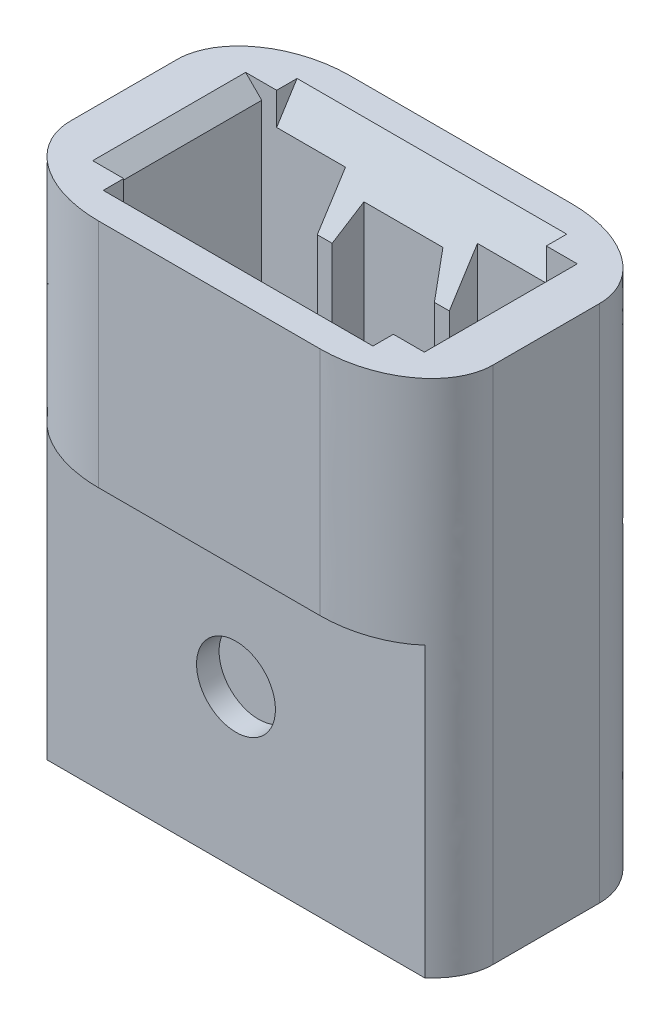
ISO-10303-21;
HEADER;
FILE_DESCRIPTION(('STEP AP214'),'2;1');
FILE_NAME('part.step','',(''),(''),'','','');
FILE_SCHEMA(('AUTOMOTIVE_DESIGN { 1 0 10303 214 1 1 1 1 }'));
ENDSEC;
DATA;
#1=APPLICATION_CONTEXT('core data for automotive mechanical design processes');
#2=APPLICATION_PROTOCOL_DEFINITION('international standard','automotive_design',2000,#1);
#3=PRODUCT_CONTEXT('',#1,'mechanical');
#4=PRODUCT('Part','Part','',(#3));
#5=PRODUCT_RELATED_PRODUCT_CATEGORY('part','',(#4));
#6=PRODUCT_DEFINITION_FORMATION('','',#4);
#7=PRODUCT_DEFINITION_CONTEXT('part definition',#1,'design');
#8=PRODUCT_DEFINITION('design','',#6,#7);
#9=PRODUCT_DEFINITION_SHAPE('','',#8);
#10=(LENGTH_UNIT() NAMED_UNIT(*) SI_UNIT(.MILLI.,.METRE.));
#11=(NAMED_UNIT(*) PLANE_ANGLE_UNIT() SI_UNIT($,.RADIAN.));
#12=(NAMED_UNIT(*) SI_UNIT($,.STERADIAN.) SOLID_ANGLE_UNIT());
#13=UNCERTAINTY_MEASURE_WITH_UNIT(LENGTH_MEASURE(1.E-05),#10,'distance_accuracy_value','');
#14=(GEOMETRIC_REPRESENTATION_CONTEXT(3) GLOBAL_UNCERTAINTY_ASSIGNED_CONTEXT((#13)) GLOBAL_UNIT_ASSIGNED_CONTEXT((#10,
#11,#12)) REPRESENTATION_CONTEXT('',''));
#15=CARTESIAN_POINT('',(0.,0.,0.));
#16=DIRECTION('',(0.,0.,1.));
#17=DIRECTION('',(1.,0.,0.));
#18=AXIS2_PLACEMENT_3D('',#15,#16,#17);
#19=CARTESIAN_POINT('',(-4.7244,-16.383,-2.413));
#20=DIRECTION('',(0.,0.,-1.));
#21=DIRECTION('',(-1.,0.,0.));
#22=AXIS2_PLACEMENT_3D('',#19,#20,#21);
#23=PLANE('',#22);
#24=DIRECTION('',(1.,0.,0.));
#25=VECTOR('',#24,1.);
#26=CARTESIAN_POINT('',(-4.7244,-1.01643211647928,-2.413));
#27=LINE('',#26,#25);
#28=CARTESIAN_POINT('',(-4.2545,-1.01643211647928,-2.413));
#29=VERTEX_POINT('',#28);
#30=CARTESIAN_POINT('',(-2.0828,-1.01643211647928,-2.413));
#31=VERTEX_POINT('',#30);
#32=EDGE_CURVE('E353',#29,#31,#27,.T.);
#33=ORIENTED_EDGE('',*,*,#32,.F.);
#34=DIRECTION('',(0.,-1.,0.));
#35=VECTOR('',#34,1.);
#36=CARTESIAN_POINT('',(-4.2545,-16.383,-2.413));
#37=LINE('',#36,#35);
#38=CARTESIAN_POINT('',(-4.2545,0.,-2.413));
#39=VERTEX_POINT('',#38);
#40=EDGE_CURVE('E366',#39,#29,#37,.T.);
#41=ORIENTED_EDGE('',*,*,#40,.F.);
#42=DIRECTION('',(-1.,0.,0.));
#43=VECTOR('',#42,1.);
#44=CARTESIAN_POINT('',(-4.7244,0.,-2.413));
#45=LINE('',#44,#43);
#46=CARTESIAN_POINT('',(-5.23240000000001,0.,-2.413));
#47=VERTEX_POINT('',#46);
#48=EDGE_CURVE('E451',#39,#47,#45,.T.);
#49=ORIENTED_EDGE('',*,*,#48,.T.);
#50=DIRECTION('',(0.707106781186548,-0.707106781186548,0.));
#51=VECTOR('',#50,1.);
#52=CARTESIAN_POINT('',(3.2131,-8.4455,-2.413));
#53=LINE('',#52,#51);
#54=CARTESIAN_POINT('',(-4.7244,-0.508000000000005,-2.413));
#55=VERTEX_POINT('',#54);
#56=EDGE_CURVE('E683',#47,#55,#53,.T.);
#57=ORIENTED_EDGE('',*,*,#56,.T.);
#58=DIRECTION('',(0.,1.,0.));
#59=VECTOR('',#58,1.);
#60=CARTESIAN_POINT('',(-4.7244,-16.383,-2.413));
#61=LINE('',#60,#59);
#62=CARTESIAN_POINT('',(-4.7244,-16.383,-2.413));
#63=VERTEX_POINT('',#62);
#64=EDGE_CURVE('E480',#63,#55,#61,.T.);
#65=ORIENTED_EDGE('',*,*,#64,.F.);
#66=DIRECTION('',(-1.,0.,0.));
#67=VECTOR('',#66,1.);
#68=CARTESIAN_POINT('',(-4.7244,-16.383,-2.413));
#69=LINE('',#68,#67);
#70=CARTESIAN_POINT('',(-2.0828,-16.383,-2.413));
#71=VERTEX_POINT('',#70);
#72=EDGE_CURVE('E455',#71,#63,#69,.T.);
#73=ORIENTED_EDGE('',*,*,#72,.F.);
#74=DIRECTION('',(0.,1.,0.));
#75=VECTOR('',#74,1.);
#76=CARTESIAN_POINT('',(-2.0828,-16.383,-2.413));
#77=LINE('',#76,#75);
#78=EDGE_CURVE('E434',#71,#31,#77,.T.);
#79=ORIENTED_EDGE('',*,*,#78,.T.);
#80=EDGE_LOOP('',(#33,#41,#49,#57,#65,#73,#79));
#81=FACE_BOUND('',#80,.T.);
#82=ADVANCED_FACE('F34',(#81),#23,.F.);
#83=DIRECTION('',(1.,0.,0.));
#84=VECTOR('',#83,1.);
#85=CARTESIAN_POINT('',(-4.7244,-1.01643211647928,-2.413));
#86=LINE('',#85,#84);
#87=CARTESIAN_POINT('',(2.0828,-1.01643211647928,-2.413));
#88=VERTEX_POINT('',#87);
#89=CARTESIAN_POINT('',(4.2545,-1.01643211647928,-2.413));
#90=VERTEX_POINT('',#89);
#91=EDGE_CURVE('E364',#88,#90,#86,.T.);
#92=ORIENTED_EDGE('',*,*,#91,.F.);
#93=DIRECTION('',(0.,1.,0.));
#94=VECTOR('',#93,1.);
#95=CARTESIAN_POINT('',(2.0828,-16.383,-2.413));
#96=LINE('',#95,#94);
#97=CARTESIAN_POINT('',(2.0828,-16.383,-2.413));
#98=VERTEX_POINT('',#97);
#99=EDGE_CURVE('E438',#98,#88,#96,.T.);
#100=ORIENTED_EDGE('',*,*,#99,.F.);
#101=CARTESIAN_POINT('',(4.7244,-16.383,-2.413));
#102=VERTEX_POINT('',#101);
#103=EDGE_CURVE('E457',#102,#98,#69,.T.);
#104=ORIENTED_EDGE('',*,*,#103,.F.);
#105=DIRECTION('',(0.,1.,0.));
#106=VECTOR('',#105,1.);
#107=CARTESIAN_POINT('',(4.7244,-16.383,-2.413));
#108=LINE('',#107,#106);
#109=CARTESIAN_POINT('',(4.7244,-0.508000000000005,-2.413));
#110=VERTEX_POINT('',#109);
#111=EDGE_CURVE('E467',#102,#110,#108,.T.);
#112=ORIENTED_EDGE('',*,*,#111,.T.);
#113=DIRECTION('',(0.707106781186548,0.707106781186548,0.));
#114=VECTOR('',#113,1.);
#115=CARTESIAN_POINT('',(-7.9375,-13.1699,-2.413));
#116=LINE('',#115,#114);
#117=CARTESIAN_POINT('',(5.23240000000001,0.,-2.413));
#118=VERTEX_POINT('',#117);
#119=EDGE_CURVE('E675',#110,#118,#116,.T.);
#120=ORIENTED_EDGE('',*,*,#119,.T.);
#121=CARTESIAN_POINT('',(4.2545,0.,-2.413));
#122=VERTEX_POINT('',#121);
#123=EDGE_CURVE('E468',#118,#122,#45,.T.);
#124=ORIENTED_EDGE('',*,*,#123,.T.);
#125=DIRECTION('',(0.,-1.,0.));
#126=VECTOR('',#125,1.);
#127=CARTESIAN_POINT('',(4.2545,-16.383,-2.413));
#128=LINE('',#127,#126);
#129=EDGE_CURVE('E687',#122,#90,#128,.T.);
#130=ORIENTED_EDGE('',*,*,#129,.T.);
#131=EDGE_LOOP('',(#92,#100,#104,#112,#120,#124,#130));
#132=FACE_BOUND('',#131,.T.);
#133=ADVANCED_FACE('F550',(#132),#23,.F.);
#134=CARTESIAN_POINT('',(2.0828,-16.383,2.413));
#135=DIRECTION('',(1.,0.,0.));
#136=DIRECTION('',(0.,0.,-1.));
#137=AXIS2_PLACEMENT_3D('',#134,#135,#136);
#138=PLANE('',#137);
#139=DIRECTION('',(0.,-0.844308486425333,-0.535857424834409));
#140=VECTOR('',#139,1.);
#141=CARTESIAN_POINT('',(2.0828,-11.9705948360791,-4.53928049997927));
#142=LINE('',#141,#140);
#143=CARTESIAN_POINT('',(2.0828,-1.01643211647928,2.413));
#144=VERTEX_POINT('',#143);
#145=CARTESIAN_POINT('',(2.0828,-2.41715964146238,1.524));
#146=VERTEX_POINT('',#145);
#147=EDGE_CURVE('E49',#144,#146,#142,.T.);
#148=ORIENTED_EDGE('',*,*,#147,.F.);
#149=DIRECTION('',(0.,1.,0.));
#150=VECTOR('',#149,1.);
#151=CARTESIAN_POINT('',(2.0828,-16.383,2.413));
#152=LINE('',#151,#150);
#153=CARTESIAN_POINT('',(2.0828,-16.383,2.413));
#154=VERTEX_POINT('',#153);
#155=EDGE_CURVE('E441',#154,#144,#152,.T.);
#156=ORIENTED_EDGE('',*,*,#155,.F.);
#157=DIRECTION('',(0.,0.,-1.));
#158=VECTOR('',#157,1.);
#159=CARTESIAN_POINT('',(2.0828,-16.383,2.413));
#160=LINE('',#159,#158);
#161=EDGE_CURVE('E430',#154,#98,#160,.T.);
#162=ORIENTED_EDGE('',*,*,#161,.T.);
#163=ORIENTED_EDGE('',*,*,#99,.T.);
#164=DIRECTION('',(0.,-0.844308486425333,0.535857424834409));
#165=VECTOR('',#164,1.);
#166=CARTESIAN_POINT('',(2.0828,-14.1540170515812,5.92503348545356));
#167=LINE('',#166,#165);
#168=CARTESIAN_POINT('',(2.0828,-2.41715964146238,-1.524));
#169=VERTEX_POINT('',#168);
#170=EDGE_CURVE('E361',#88,#169,#167,.T.);
#171=ORIENTED_EDGE('',*,*,#170,.T.);
#172=DIRECTION('',(0.,1.,0.));
#173=VECTOR('',#172,1.);
#174=CARTESIAN_POINT('',(2.0828,-16.383,-1.524));
#175=LINE('',#174,#173);
#176=CARTESIAN_POINT('',(2.0828,-9.525,-1.524));
#177=VERTEX_POINT('',#176);
#178=EDGE_CURVE('E383',#177,#169,#175,.T.);
#179=ORIENTED_EDGE('',*,*,#178,.F.);
#180=DIRECTION('',(0.,0.,1.));
#181=VECTOR('',#180,1.);
#182=CARTESIAN_POINT('',(2.0828,-9.525,2.413));
#183=LINE('',#182,#181);
#184=CARTESIAN_POINT('',(2.0828,-9.525,1.524));
#185=VERTEX_POINT('',#184);
#186=EDGE_CURVE('E416',#177,#185,#183,.T.);
#187=ORIENTED_EDGE('',*,*,#186,.T.);
#188=DIRECTION('',(0.,-1.,0.));
#189=VECTOR('',#188,1.);
#190=CARTESIAN_POINT('',(2.0828,-16.383,1.524));
#191=LINE('',#190,#189);
#192=EDGE_CURVE('E394',#146,#185,#191,.T.);
#193=ORIENTED_EDGE('',*,*,#192,.F.);
#194=EDGE_LOOP('',(#148,#156,#162,#163,#171,#179,#187,#193));
#195=FACE_BOUND('',#194,.T.);
#196=ADVANCED_FACE('F556',(#195),#138,.T.);
#197=CARTESIAN_POINT('',(-2.0828,-16.383,2.413));
#198=DIRECTION('',(-1.,0.,0.));
#199=DIRECTION('',(0.,0.,1.));
#200=AXIS2_PLACEMENT_3D('',#197,#198,#199);
#201=PLANE('',#200);
#202=DIRECTION('',(0.,0.844308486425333,0.535857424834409));
#203=VECTOR('',#202,1.);
#204=CARTESIAN_POINT('',(-2.0828,-11.9705948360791,-4.53928049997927));
#205=LINE('',#204,#203);
#206=CARTESIAN_POINT('',(-2.0828,-2.41715964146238,1.524));
#207=VERTEX_POINT('',#206);
#208=CARTESIAN_POINT('',(-2.0828,-1.01643211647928,2.413));
#209=VERTEX_POINT('',#208);
#210=EDGE_CURVE('E334',#207,#209,#205,.T.);
#211=ORIENTED_EDGE('',*,*,#210,.F.);
#212=DIRECTION('',(0.,1.,0.));
#213=VECTOR('',#212,1.);
#214=CARTESIAN_POINT('',(-2.0828,-16.383,1.524));
#215=LINE('',#214,#213);
#216=CARTESIAN_POINT('',(-2.0828,-9.525,1.524));
#217=VERTEX_POINT('',#216);
#218=EDGE_CURVE('E391',#217,#207,#215,.T.);
#219=ORIENTED_EDGE('',*,*,#218,.F.);
#220=DIRECTION('',(0.,0.,-1.));
#221=VECTOR('',#220,1.);
#222=CARTESIAN_POINT('',(-2.0828,-9.525,2.413));
#223=LINE('',#222,#221);
#224=CARTESIAN_POINT('',(-2.0828,-9.525,-1.524));
#225=VERTEX_POINT('',#224);
#226=EDGE_CURVE('E660',#217,#225,#223,.T.);
#227=ORIENTED_EDGE('',*,*,#226,.T.);
#228=DIRECTION('',(0.,-1.,0.));
#229=VECTOR('',#228,1.);
#230=CARTESIAN_POINT('',(-2.0828,-16.383,-1.524));
#231=LINE('',#230,#229);
#232=CARTESIAN_POINT('',(-2.0828,-2.41715964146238,-1.524));
#233=VERTEX_POINT('',#232);
#234=EDGE_CURVE('E381',#233,#225,#231,.T.);
#235=ORIENTED_EDGE('',*,*,#234,.F.);
#236=DIRECTION('',(0.,0.844308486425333,-0.535857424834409));
#237=VECTOR('',#236,1.);
#238=CARTESIAN_POINT('',(-2.0828,-14.1540170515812,5.92503348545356));
#239=LINE('',#238,#237);
#240=EDGE_CURVE('E57',#233,#31,#239,.T.);
#241=ORIENTED_EDGE('',*,*,#240,.T.);
#242=ORIENTED_EDGE('',*,*,#78,.F.);
#243=DIRECTION('',(0.,0.,1.));
#244=VECTOR('',#243,1.);
#245=CARTESIAN_POINT('',(-2.0828,-16.383,2.413));
#246=LINE('',#245,#244);
#247=CARTESIAN_POINT('',(-2.0828,-16.383,2.413));
#248=VERTEX_POINT('',#247);
#249=EDGE_CURVE('E427',#71,#248,#246,.T.);
#250=ORIENTED_EDGE('',*,*,#249,.T.);
#251=DIRECTION('',(0.,1.,0.));
#252=VECTOR('',#251,1.);
#253=CARTESIAN_POINT('',(-2.0828,-16.383,2.413));
#254=LINE('',#253,#252);
#255=EDGE_CURVE('E433',#248,#209,#254,.T.);
#256=ORIENTED_EDGE('',*,*,#255,.T.);
#257=EDGE_LOOP('',(#211,#219,#227,#235,#241,#242,#250,#256));
#258=FACE_BOUND('',#257,.T.);
#259=ADVANCED_FACE('F714',(#258),#201,.T.);
#260=CARTESIAN_POINT('',(-1.2464992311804,-9.525,-2.159));
#261=DIRECTION('',(-0.866025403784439,0.,-0.5));
#262=DIRECTION('',(-0.5,0.,0.866025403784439));
#263=AXIS2_PLACEMENT_3D('',#260,#261,#262);
#264=PLANE('',#263);
#265=DIRECTION('',(0.295556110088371,0.806589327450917,-0.511918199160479));
#266=VECTOR('',#265,1.);
#267=CARTESIAN_POINT('',(-3.1794706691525,-6.69182827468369,1.18900474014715));
#268=LINE('',#267,#266);
#269=CARTESIAN_POINT('',(-1.61311665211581,-2.41715964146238,-1.524));
#270=VERTEX_POINT('',#269);
#271=CARTESIAN_POINT('',(-1.2464992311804,-1.41663998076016,-2.159));
#272=VERTEX_POINT('',#271);
#273=EDGE_CURVE('E350',#270,#272,#268,.T.);
#274=ORIENTED_EDGE('',*,*,#273,.F.);
#275=DIRECTION('',(0.,-1.,0.));
#276=VECTOR('',#275,1.);
#277=CARTESIAN_POINT('',(-1.61311665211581,-9.525,-1.524));
#278=LINE('',#277,#276);
#279=CARTESIAN_POINT('',(-1.61311665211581,-9.525,-1.524));
#280=VERTEX_POINT('',#279);
#281=EDGE_CURVE('E379',#270,#280,#278,.T.);
#282=ORIENTED_EDGE('',*,*,#281,.T.);
#283=DIRECTION('',(-0.5,0.,0.866025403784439));
#284=VECTOR('',#283,1.);
#285=CARTESIAN_POINT('',(-1.2464992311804,-9.525,-2.159));
#286=LINE('',#285,#284);
#287=CARTESIAN_POINT('',(-1.2464992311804,-9.525,-2.159));
#288=VERTEX_POINT('',#287);
#289=EDGE_CURVE('E404',#288,#280,#286,.T.);
#290=ORIENTED_EDGE('',*,*,#289,.F.);
#291=DIRECTION('',(0.,1.,0.));
#292=VECTOR('',#291,1.);
#293=CARTESIAN_POINT('',(-1.2464992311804,-9.525,-2.159));
#294=LINE('',#293,#292);
#295=EDGE_CURVE('E420',#288,#272,#294,.T.);
#296=ORIENTED_EDGE('',*,*,#295,.T.);
#297=EDGE_LOOP('',(#274,#282,#290,#296));
#298=FACE_BOUND('',#297,.T.);
#299=ADVANCED_FACE('F740',(#298),#264,.F.);
#300=CARTESIAN_POINT('',(1.2464992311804,-9.525,-2.159));
#301=DIRECTION('',(0.,0.,-1.));
#302=DIRECTION('',(-1.,0.,0.));
#303=AXIS2_PLACEMENT_3D('',#300,#301,#302);
#304=PLANE('',#303);
#305=DIRECTION('',(1.,0.,0.));
#306=VECTOR('',#305,1.);
#307=CARTESIAN_POINT('',(1.2464992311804,-1.41663998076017,-2.159));
#308=LINE('',#307,#306);
#309=CARTESIAN_POINT('',(1.2464992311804,-1.41663998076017,-2.159));
#310=VERTEX_POINT('',#309);
#311=EDGE_CURVE('E355',#272,#310,#308,.T.);
#312=ORIENTED_EDGE('',*,*,#311,.F.);
#313=ORIENTED_EDGE('',*,*,#295,.F.);
#314=DIRECTION('',(-1.,0.,0.));
#315=VECTOR('',#314,1.);
#316=CARTESIAN_POINT('',(1.2464992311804,-9.525,-2.159));
#317=LINE('',#316,#315);
#318=CARTESIAN_POINT('',(1.2464992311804,-9.525,-2.159));
#319=VERTEX_POINT('',#318);
#320=EDGE_CURVE('E401',#319,#288,#317,.T.);
#321=ORIENTED_EDGE('',*,*,#320,.F.);
#322=DIRECTION('',(0.,1.,0.));
#323=VECTOR('',#322,1.);
#324=CARTESIAN_POINT('',(1.2464992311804,-9.525,-2.159));
#325=LINE('',#324,#323);
#326=EDGE_CURVE('E412',#319,#310,#325,.T.);
#327=ORIENTED_EDGE('',*,*,#326,.T.);
#328=EDGE_LOOP('',(#312,#313,#321,#327));
#329=FACE_BOUND('',#328,.T.);
#330=ADVANCED_FACE('F744',(#329),#304,.F.);
#331=CARTESIAN_POINT('',(2.4929984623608,-9.525,0.));
#332=DIRECTION('',(0.866025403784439,0.,-0.5));
#333=DIRECTION('',(-0.5,0.,-0.866025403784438));
#334=AXIS2_PLACEMENT_3D('',#331,#332,#333);
#335=PLANE('',#334);
#336=DIRECTION('',(0.295556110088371,-0.806589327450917,0.511918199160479));
#337=VECTOR('',#336,1.);
#338=CARTESIAN_POINT('',(3.61501452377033,-7.88045206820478,1.94338882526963));
#339=LINE('',#338,#337);
#340=CARTESIAN_POINT('',(1.61311665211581,-2.41715964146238,-1.524));
#341=VERTEX_POINT('',#340);
#342=EDGE_CURVE('E357',#310,#341,#339,.T.);
#343=ORIENTED_EDGE('',*,*,#342,.F.);
#344=ORIENTED_EDGE('',*,*,#326,.F.);
#345=DIRECTION('',(-0.5,0.,-0.866025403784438));
#346=VECTOR('',#345,1.);
#347=CARTESIAN_POINT('',(2.4929984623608,-9.525,0.));
#348=LINE('',#347,#346);
#349=CARTESIAN_POINT('',(1.61311665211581,-9.525,-1.524));
#350=VERTEX_POINT('',#349);
#351=EDGE_CURVE('E399',#350,#319,#348,.T.);
#352=ORIENTED_EDGE('',*,*,#351,.F.);
#353=DIRECTION('',(0.,1.,0.));
#354=VECTOR('',#353,1.);
#355=CARTESIAN_POINT('',(1.61311665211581,-9.525,-1.524));
#356=LINE('',#355,#354);
#357=EDGE_CURVE('E376',#350,#341,#356,.T.);
#358=ORIENTED_EDGE('',*,*,#357,.T.);
#359=EDGE_LOOP('',(#343,#344,#352,#358));
#360=FACE_BOUND('',#359,.T.);
#361=ADVANCED_FACE('F749',(#360),#335,.F.);
#362=CARTESIAN_POINT('',(-3.15613988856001,-9.525,-1.524));
#363=DIRECTION('',(0.,0.,-1.));
#364=DIRECTION('',(-1.,0.,0.));
#365=AXIS2_PLACEMENT_3D('',#362,#363,#364);
#366=PLANE('',#365);
#367=DIRECTION('',(1.,0.,0.));
#368=VECTOR('',#367,1.);
#369=CARTESIAN_POINT('',(-3.15613988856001,-2.41715964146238,-1.524));
#370=LINE('',#369,#368);
#371=EDGE_CURVE('E359',#341,#169,#370,.T.);
#372=ORIENTED_EDGE('',*,*,#371,.F.);
#373=ORIENTED_EDGE('',*,*,#357,.F.);
#374=DIRECTION('',(-1.,0.,0.));
#375=VECTOR('',#374,1.);
#376=CARTESIAN_POINT('',(-3.15613988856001,-9.525,-1.524));
#377=LINE('',#376,#375);
#378=EDGE_CURVE('E371',#177,#350,#377,.T.);
#379=ORIENTED_EDGE('',*,*,#378,.F.);
#380=ORIENTED_EDGE('',*,*,#178,.T.);
#381=EDGE_LOOP('',(#372,#373,#379,#380));
#382=FACE_BOUND('',#381,.T.);
#383=ADVANCED_FACE('F753',(#382),#366,.F.);
#384=DIRECTION('',(1.,0.,0.));
#385=VECTOR('',#384,1.);
#386=CARTESIAN_POINT('',(-3.15613988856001,-2.41715964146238,-1.524));
#387=LINE('',#386,#385);
#388=EDGE_CURVE('E685',#233,#270,#387,.T.);
#389=ORIENTED_EDGE('',*,*,#388,.F.);
#390=ORIENTED_EDGE('',*,*,#234,.T.);
#391=EDGE_CURVE('E368',#280,#225,#377,.T.);
#392=ORIENTED_EDGE('',*,*,#391,.F.);
#393=ORIENTED_EDGE('',*,*,#281,.F.);
#394=EDGE_LOOP('',(#389,#390,#392,#393));
#395=FACE_BOUND('',#394,.T.);
#396=ADVANCED_FACE('F734',(#395),#366,.F.);
#397=CARTESIAN_POINT('',(-4.7244,-16.383,2.413));
#398=DIRECTION('',(0.,0.,1.));
#399=DIRECTION('',(1.,0.,0.));
#400=AXIS2_PLACEMENT_3D('',#397,#398,#399);
#401=PLANE('',#400);
#402=DIRECTION('',(0.,1.,0.));
#403=VECTOR('',#402,1.);
#404=CARTESIAN_POINT('',(-4.2545,-16.383,2.413));
#405=LINE('',#404,#403);
#406=CARTESIAN_POINT('',(-4.2545,-1.01643211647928,2.413));
#407=VERTEX_POINT('',#406);
#408=CARTESIAN_POINT('',(-4.2545,0.,2.413));
#409=VERTEX_POINT('',#408);
#410=EDGE_CURVE('E306',#407,#409,#405,.T.);
#411=ORIENTED_EDGE('',*,*,#410,.F.);
#412=DIRECTION('',(1.,0.,0.));
#413=VECTOR('',#412,1.);
#414=CARTESIAN_POINT('',(-4.7244,-1.01643211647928,2.413));
#415=LINE('',#414,#413);
#416=EDGE_CURVE('E298',#407,#209,#415,.T.);
#417=ORIENTED_EDGE('',*,*,#416,.T.);
#418=ORIENTED_EDGE('',*,*,#255,.F.);
#419=DIRECTION('',(1.,0.,0.));
#420=VECTOR('',#419,1.);
#421=CARTESIAN_POINT('',(-4.7244,-16.383,2.413));
#422=LINE('',#421,#420);
#423=CARTESIAN_POINT('',(-4.7244,-16.383,2.413));
#424=VERTEX_POINT('',#423);
#425=EDGE_CURVE('E464',#424,#248,#422,.T.);
#426=ORIENTED_EDGE('',*,*,#425,.F.);
#427=DIRECTION('',(0.,1.,0.));
#428=VECTOR('',#427,1.);
#429=CARTESIAN_POINT('',(-4.7244,-16.383,2.413));
#430=LINE('',#429,#428);
#431=CARTESIAN_POINT('',(-4.7244,-0.508000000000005,2.413));
#432=VERTEX_POINT('',#431);
#433=EDGE_CURVE('E477',#424,#432,#430,.T.);
#434=ORIENTED_EDGE('',*,*,#433,.T.);
#435=DIRECTION('',(-0.707106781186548,0.707106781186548,0.));
#436=VECTOR('',#435,1.);
#437=CARTESIAN_POINT('',(3.2131,-8.4455,2.413));
#438=LINE('',#437,#436);
#439=CARTESIAN_POINT('',(-5.23240000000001,0.,2.413));
#440=VERTEX_POINT('',#439);
#441=EDGE_CURVE('E680',#432,#440,#438,.T.);
#442=ORIENTED_EDGE('',*,*,#441,.T.);
#443=DIRECTION('',(1.,0.,0.));
#444=VECTOR('',#443,1.);
#445=CARTESIAN_POINT('',(-4.7244,0.,2.413));
#446=LINE('',#445,#444);
#447=EDGE_CURVE('E456',#440,#409,#446,.T.);
#448=ORIENTED_EDGE('',*,*,#447,.T.);
#449=EDGE_LOOP('',(#411,#417,#418,#426,#434,#442,#448));
#450=FACE_BOUND('',#449,.T.);
#451=ADVANCED_FACE('F717',(#450),#401,.F.);
#452=CARTESIAN_POINT('',(0.,-11.4046,-3.96875));
#453=DIRECTION('',(0.,0.,1.));
#454=DIRECTION('',(1.,0.,0.));
#455=AXIS2_PLACEMENT_3D('',#452,#453,#454);
#456=CYLINDRICAL_SURFACE('',#455,1.2446);
#457=CARTESIAN_POINT('',(0.,-11.4046,2.413));
#458=DIRECTION('',(0.,0.,1.));
#459=DIRECTION('',(1.,0.,0.));
#460=AXIS2_PLACEMENT_3D('',#457,#458,#459);
#461=CIRCLE('',#460,1.2446);
#462=CARTESIAN_POINT('',(1.2446,-11.4046,2.413));
#463=VERTEX_POINT('',#462);
#464=EDGE_CURVE('E437',#463,#463,#461,.F.);
#465=ORIENTED_EDGE('',*,*,#464,.T.);
#466=EDGE_LOOP('',(#465));
#467=FACE_BOUND('',#466,.T.);
#468=CARTESIAN_POINT('',(0.,-11.4046,3.1242));
#469=DIRECTION('',(0.,0.,1.));
#470=DIRECTION('',(1.,0.,0.));
#471=AXIS2_PLACEMENT_3D('',#468,#469,#470);
#472=CIRCLE('',#471,1.2446);
#473=CARTESIAN_POINT('',(1.2446,-11.4046,3.1242));
#474=VERTEX_POINT('',#473);
#475=EDGE_CURVE('E488',#474,#474,#472,.F.);
#476=ORIENTED_EDGE('',*,*,#475,.F.);
#477=EDGE_LOOP('',(#476));
#478=FACE_BOUND('',#477,.T.);
#479=ADVANCED_FACE('F589',(#467,#478),#456,.F.);
#480=CARTESIAN_POINT('',(3.49250000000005,-16.383,1.68275000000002));
#481=DIRECTION('',(0.,1.,0.));
#482=DIRECTION('',(1.,0.,0.));
#483=AXIS2_PLACEMENT_3D('',#480,#481,#482);
#484=ELLIPSE('',#483,3.175,2.286);
#485=DIRECTION('',(0.,1.,0.));
#486=VECTOR('',#485,1.);
#487=SURFACE_OF_LINEAR_EXTRUSION('',#484,#486);
#488=CARTESIAN_POINT('',(3.49250000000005,-7.2898,1.68275000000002));
#489=DIRECTION('',(0.,1.,0.));
#490=DIRECTION('',(1.,0.,0.));
#491=AXIS2_PLACEMENT_3D('',#488,#489,#490);
#492=ELLIPSE('',#491,3.175,2.286);
#493=CARTESIAN_POINT('',(3.49250000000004,-7.2898,3.96875000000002));
#494=VERTEX_POINT('',#493);
#495=CARTESIAN_POINT('',(5.95675757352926,-7.2898,3.1242));
#496=VERTEX_POINT('',#495);
#497=EDGE_CURVE('E500',#494,#496,#492,.T.);
#498=ORIENTED_EDGE('',*,*,#497,.T.);
#499=DIRECTION('',(0.,1.,0.));
#500=VECTOR('',#499,1.);
#501=CARTESIAN_POINT('',(5.95675757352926,-16.383,3.1242));
#502=LINE('',#501,#500);
#503=CARTESIAN_POINT('',(5.95675757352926,-16.383,3.1242));
#504=VERTEX_POINT('',#503);
#505=EDGE_CURVE('E494',#496,#504,#502,.F.);
#506=ORIENTED_EDGE('',*,*,#505,.T.);
#507=CARTESIAN_POINT('',(6.66750000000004,-16.383,1.68275000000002));
#508=VERTEX_POINT('',#507);
#509=EDGE_CURVE('E1019',#504,#508,#484,.T.);
#510=ORIENTED_EDGE('',*,*,#509,.T.);
#511=DIRECTION('',(0.,1.,0.));
#512=VECTOR('',#511,1.);
#513=CARTESIAN_POINT('',(6.66750000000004,-16.383,1.68275000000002));
#514=LINE('',#513,#512);
#515=CARTESIAN_POINT('',(6.66750000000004,0.,1.68275000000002));
#516=VERTEX_POINT('',#515);
#517=EDGE_CURVE('E642',#508,#516,#514,.T.);
#518=ORIENTED_EDGE('',*,*,#517,.T.);
#519=CARTESIAN_POINT('',(3.49250000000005,0.,1.68275000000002));
#520=DIRECTION('',(0.,1.,0.));
#521=DIRECTION('',(1.,0.,0.));
#522=AXIS2_PLACEMENT_3D('',#519,#520,#521);
#523=ELLIPSE('',#522,3.175,2.286);
#524=CARTESIAN_POINT('',(3.49250000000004,0.,3.96875000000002));
#525=VERTEX_POINT('',#524);
#526=EDGE_CURVE('E624',#525,#516,#523,.T.);
#527=ORIENTED_EDGE('',*,*,#526,.F.);
#528=DIRECTION('',(0.,1.,0.));
#529=VECTOR('',#528,1.);
#530=CARTESIAN_POINT('',(3.49250000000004,-16.383,3.96875000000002));
#531=LINE('',#530,#529);
#532=EDGE_CURVE('E644',#494,#525,#531,.T.);
#533=ORIENTED_EDGE('',*,*,#532,.F.);
#534=EDGE_LOOP('',(#498,#506,#510,#518,#527,#533));
#535=FACE_BOUND('',#534,.T.);
#536=ADVANCED_FACE('F815',(#535),#487,.T.);
#537=CARTESIAN_POINT('',(3.49250000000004,-16.383,3.96875000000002));
#538=DIRECTION('',(0.,0.,1.));
#539=DIRECTION('',(1.,0.,0.));
#540=AXIS2_PLACEMENT_3D('',#537,#538,#539);
#541=PLANE('',#540);
#542=DIRECTION('',(0.,1.,0.));
#543=VECTOR('',#542,1.);
#544=CARTESIAN_POINT('',(-3.49250000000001,-16.383,3.96875000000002));
#545=LINE('',#544,#543);
#546=CARTESIAN_POINT('',(-3.49250000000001,-7.2898,3.96875000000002));
#547=VERTEX_POINT('',#546);
#548=CARTESIAN_POINT('',(-3.49250000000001,0.,3.96875000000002));
#549=VERTEX_POINT('',#548);
#550=EDGE_CURVE('E646',#547,#549,#545,.T.);
#551=ORIENTED_EDGE('',*,*,#550,.F.);
#552=DIRECTION('',(1.,0.,0.));
#553=VECTOR('',#552,1.);
#554=CARTESIAN_POINT('',(3.49250000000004,-7.2898,3.96875000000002));
#555=LINE('',#554,#553);
#556=EDGE_CURVE('E497',#547,#494,#555,.T.);
#557=ORIENTED_EDGE('',*,*,#556,.T.);
#558=ORIENTED_EDGE('',*,*,#532,.T.);
#559=DIRECTION('',(1.,0.,0.));
#560=VECTOR('',#559,1.);
#561=CARTESIAN_POINT('',(3.49250000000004,0.,3.96875000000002));
#562=LINE('',#561,#560);
#563=EDGE_CURVE('E621',#549,#525,#562,.T.);
#564=ORIENTED_EDGE('',*,*,#563,.F.);
#565=EDGE_LOOP('',(#551,#557,#558,#564));
#566=FACE_BOUND('',#565,.T.);
#567=ADVANCED_FACE('F945',(#566),#541,.T.);
#568=CARTESIAN_POINT('',(-3.49250000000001,-16.383,1.68275000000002));
#569=DIRECTION('',(0.,1.,0.));
#570=DIRECTION('',(-1.,0.,0.));
#571=AXIS2_PLACEMENT_3D('',#568,#569,#570);
#572=ELLIPSE('',#571,3.175,2.286);
#573=DIRECTION('',(0.,1.,0.));
#574=VECTOR('',#573,1.);
#575=SURFACE_OF_LINEAR_EXTRUSION('',#572,#574);
#576=CARTESIAN_POINT('',(-6.66750000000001,-16.383,1.68275000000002));
#577=VERTEX_POINT('',#576);
#578=CARTESIAN_POINT('',(-5.95675757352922,-16.383,3.1242));
#579=VERTEX_POINT('',#578);
#580=EDGE_CURVE('E1020',#577,#579,#572,.T.);
#581=ORIENTED_EDGE('',*,*,#580,.T.);
#582=DIRECTION('',(0.,1.,0.));
#583=VECTOR('',#582,1.);
#584=CARTESIAN_POINT('',(-5.95675757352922,-16.383,3.1242));
#585=LINE('',#584,#583);
#586=CARTESIAN_POINT('',(-5.95675757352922,-7.2898,3.1242));
#587=VERTEX_POINT('',#586);
#588=EDGE_CURVE('E491',#579,#587,#585,.T.);
#589=ORIENTED_EDGE('',*,*,#588,.T.);
#590=CARTESIAN_POINT('',(-3.49250000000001,-7.2898,1.68275000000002));
#591=DIRECTION('',(0.,1.,0.));
#592=DIRECTION('',(-1.,0.,0.));
#593=AXIS2_PLACEMENT_3D('',#590,#591,#592);
#594=ELLIPSE('',#593,3.175,2.286);
#595=EDGE_CURVE('E655',#587,#547,#594,.T.);
#596=ORIENTED_EDGE('',*,*,#595,.T.);
#597=ORIENTED_EDGE('',*,*,#550,.T.);
#598=CARTESIAN_POINT('',(-3.49250000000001,0.,1.68275000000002));
#599=DIRECTION('',(0.,1.,0.));
#600=DIRECTION('',(-1.,0.,0.));
#601=AXIS2_PLACEMENT_3D('',#598,#599,#600);
#602=ELLIPSE('',#601,3.175,2.286);
#603=CARTESIAN_POINT('',(-6.66750000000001,0.,1.68275000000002));
#604=VERTEX_POINT('',#603);
#605=EDGE_CURVE('E618',#604,#549,#602,.T.);
#606=ORIENTED_EDGE('',*,*,#605,.F.);
#607=DIRECTION('',(0.,1.,0.));
#608=VECTOR('',#607,1.);
#609=CARTESIAN_POINT('',(-6.66750000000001,-16.383,1.68275000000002));
#610=LINE('',#609,#608);
#611=EDGE_CURVE('E648',#577,#604,#610,.T.);
#612=ORIENTED_EDGE('',*,*,#611,.F.);
#613=EDGE_LOOP('',(#581,#589,#596,#597,#606,#612));
#614=FACE_BOUND('',#613,.T.);
#615=ADVANCED_FACE('F592',(#614),#575,.T.);
#616=CARTESIAN_POINT('',(-3.49250000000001,-16.383,-1.68274999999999));
#617=DIRECTION('',(0.,1.,0.));
#618=DIRECTION('',(0.,0.,1.));
#619=AXIS2_PLACEMENT_3D('',#616,#617,#618);
#620=PLANE('',#619);
#621=ORIENTED_EDGE('',*,*,#161,.F.);
#622=CARTESIAN_POINT('',(4.7244,-16.383,2.413));
#623=VERTEX_POINT('',#622);
#624=EDGE_CURVE('E463',#154,#623,#422,.T.);
#625=ORIENTED_EDGE('',*,*,#624,.T.);
#626=DIRECTION('',(0.,0.,-1.));
#627=VECTOR('',#626,1.);
#628=CARTESIAN_POINT('',(4.7244,-16.383,2.413));
#629=LINE('',#628,#627);
#630=EDGE_CURVE('E452',#623,#102,#629,.T.);
#631=ORIENTED_EDGE('',*,*,#630,.T.);
#632=ORIENTED_EDGE('',*,*,#103,.T.);
#633=EDGE_LOOP('',(#621,#625,#631,#632));
#634=FACE_BOUND('',#633,.T.);
#635=ORIENTED_EDGE('',*,*,#425,.T.);
#636=ORIENTED_EDGE('',*,*,#249,.F.);
#637=ORIENTED_EDGE('',*,*,#72,.T.);
#638=DIRECTION('',(0.,0.,1.));
#639=VECTOR('',#638,1.);
#640=CARTESIAN_POINT('',(-4.7244,-16.383,2.413));
#641=LINE('',#640,#639);
#642=EDGE_CURVE('E460',#63,#424,#641,.T.);
#643=ORIENTED_EDGE('',*,*,#642,.T.);
#644=EDGE_LOOP('',(#635,#636,#637,#643));
#645=FACE_BOUND('',#644,.T.);
#646=DIRECTION('',(-1.,0.,0.));
#647=VECTOR('',#646,1.);
#648=CARTESIAN_POINT('',(-8.90708236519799,-16.383,3.1242));
#649=LINE('',#648,#647);
#650=EDGE_CURVE('E476',#504,#579,#649,.T.);
#651=ORIENTED_EDGE('',*,*,#650,.T.);
#652=ORIENTED_EDGE('',*,*,#580,.F.);
#653=DIRECTION('',(0.,0.,1.));
#654=VECTOR('',#653,1.);
#655=CARTESIAN_POINT('',(-6.66750000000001,-16.383,-1.68274999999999));
#656=LINE('',#655,#654);
#657=CARTESIAN_POINT('',(-6.66750000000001,-16.383,-1.68274999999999));
#658=VERTEX_POINT('',#657);
#659=EDGE_CURVE('E523',#658,#577,#656,.T.);
#660=ORIENTED_EDGE('',*,*,#659,.F.);
#661=CARTESIAN_POINT('',(-3.49250000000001,-16.383,-1.68274999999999));
#662=DIRECTION('',(0.,1.,0.));
#663=DIRECTION('',(-1.,0.,0.));
#664=AXIS2_PLACEMENT_3D('',#661,#662,#663);
#665=ELLIPSE('',#664,3.175,2.286);
#666=CARTESIAN_POINT('',(-5.9567575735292,-16.383,-3.1242));
#667=VERTEX_POINT('',#666);
#668=EDGE_CURVE('E520',#667,#658,#665,.T.);
#669=ORIENTED_EDGE('',*,*,#668,.F.);
#670=DIRECTION('',(-1.,0.,0.));
#671=VECTOR('',#670,1.);
#672=CARTESIAN_POINT('',(-8.90708236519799,-16.383,-3.1242));
#673=LINE('',#672,#671);
#674=CARTESIAN_POINT('',(5.95675757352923,-16.383,-3.1242));
#675=VERTEX_POINT('',#674);
#676=EDGE_CURVE('E503',#675,#667,#673,.T.);
#677=ORIENTED_EDGE('',*,*,#676,.F.);
#678=CARTESIAN_POINT('',(3.49250000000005,-16.383,-1.68275));
#679=DIRECTION('',(0.,1.,0.));
#680=DIRECTION('',(1.,0.,0.));
#681=AXIS2_PLACEMENT_3D('',#678,#679,#680);
#682=ELLIPSE('',#681,3.175,2.286);
#683=CARTESIAN_POINT('',(6.66750000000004,-16.383,-1.68275));
#684=VERTEX_POINT('',#683);
#685=EDGE_CURVE('E605',#684,#675,#682,.T.);
#686=ORIENTED_EDGE('',*,*,#685,.F.);
#687=DIRECTION('',(0.,0.,-1.));
#688=VECTOR('',#687,1.);
#689=CARTESIAN_POINT('',(6.66750000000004,-16.383,-1.68275));
#690=LINE('',#689,#688);
#691=EDGE_CURVE('E611',#508,#684,#690,.T.);
#692=ORIENTED_EDGE('',*,*,#691,.F.);
#693=ORIENTED_EDGE('',*,*,#509,.F.);
#694=EDGE_LOOP('',(#651,#652,#660,#669,#677,#686,#692,#693));
#695=FACE_BOUND('',#694,.T.);
#696=ADVANCED_FACE('F587',(#634,#645,#695),#620,.F.);
#697=CARTESIAN_POINT('',(0.,-11.4046,-2.413));
#698=DIRECTION('',(0.,0.,-1.));
#699=DIRECTION('',(-1.,0.,0.));
#700=AXIS2_PLACEMENT_3D('',#697,#698,#699);
#701=CIRCLE('',#700,1.2446);
#702=CARTESIAN_POINT('',(-1.2446,-11.4046,-2.413));
#703=VERTEX_POINT('',#702);
#704=EDGE_CURVE('E448',#703,#703,#701,.F.);
#705=ORIENTED_EDGE('',*,*,#704,.T.);
#706=EDGE_LOOP('',(#705));
#707=FACE_BOUND('',#706,.T.);
#708=CARTESIAN_POINT('',(0.,-11.4046,-3.1242));
#709=DIRECTION('',(0.,0.,1.));
#710=DIRECTION('',(1.,0.,0.));
#711=AXIS2_PLACEMENT_3D('',#708,#709,#710);
#712=CIRCLE('',#711,1.2446);
#713=CARTESIAN_POINT('',(1.2446,-11.4046,-3.1242));
#714=VERTEX_POINT('',#713);
#715=EDGE_CURVE('E507',#714,#714,#712,.F.);
#716=ORIENTED_EDGE('',*,*,#715,.T.);
#717=EDGE_LOOP('',(#716));
#718=FACE_BOUND('',#717,.T.);
#719=ADVANCED_FACE('F584',(#707,#718),#456,.F.);
#720=CARTESIAN_POINT('',(-3.49250000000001,-16.383,-3.96874999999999));
#721=DIRECTION('',(0.,0.,-1.));
#722=DIRECTION('',(-1.,0.,0.));
#723=AXIS2_PLACEMENT_3D('',#720,#721,#722);
#724=PLANE('',#723);
#725=DIRECTION('',(0.,1.,0.));
#726=VECTOR('',#725,1.);
#727=CARTESIAN_POINT('',(3.49250000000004,-16.383,-3.96875));
#728=LINE('',#727,#726);
#729=CARTESIAN_POINT('',(3.49250000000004,-7.2898,-3.96875));
#730=VERTEX_POINT('',#729);
#731=CARTESIAN_POINT('',(3.49250000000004,0.,-3.96875));
#732=VERTEX_POINT('',#731);
#733=EDGE_CURVE('E638',#730,#732,#728,.T.);
#734=ORIENTED_EDGE('',*,*,#733,.F.);
#735=DIRECTION('',(-1.,0.,0.));
#736=VECTOR('',#735,1.);
#737=CARTESIAN_POINT('',(-3.49250000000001,-7.2898,-3.96874999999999));
#738=LINE('',#737,#736);
#739=CARTESIAN_POINT('',(-3.49250000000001,-7.2898,-3.96874999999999));
#740=VERTEX_POINT('',#739);
#741=EDGE_CURVE('E513',#730,#740,#738,.T.);
#742=ORIENTED_EDGE('',*,*,#741,.T.);
#743=DIRECTION('',(0.,1.,0.));
#744=VECTOR('',#743,1.);
#745=CARTESIAN_POINT('',(-3.49250000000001,-16.383,-3.96874999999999));
#746=LINE('',#745,#744);
#747=CARTESIAN_POINT('',(-3.49250000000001,0.,-3.96874999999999));
#748=VERTEX_POINT('',#747);
#749=EDGE_CURVE('E635',#740,#748,#746,.T.);
#750=ORIENTED_EDGE('',*,*,#749,.T.);
#751=DIRECTION('',(-1.,0.,0.));
#752=VECTOR('',#751,1.);
#753=CARTESIAN_POINT('',(-3.49250000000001,0.,-3.96874999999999));
#754=LINE('',#753,#752);
#755=EDGE_CURVE('E524',#732,#748,#754,.T.);
#756=ORIENTED_EDGE('',*,*,#755,.F.);
#757=EDGE_LOOP('',(#734,#742,#750,#756));
#758=FACE_BOUND('',#757,.T.);
#759=ADVANCED_FACE('F531',(#758),#724,.T.);
#760=DIRECTION('',(0.,1.,0.));
#761=VECTOR('',#760,1.);
#762=SURFACE_OF_LINEAR_EXTRUSION('',#665,#761);
#763=DIRECTION('',(0.,1.,0.));
#764=VECTOR('',#763,1.);
#765=CARTESIAN_POINT('',(-5.9567575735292,-16.383,-3.1242));
#766=LINE('',#765,#764);
#767=CARTESIAN_POINT('',(-5.9567575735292,-7.2898,-3.1242));
#768=VERTEX_POINT('',#767);
#769=EDGE_CURVE('E511',#667,#768,#766,.T.);
#770=ORIENTED_EDGE('',*,*,#769,.F.);
#771=ORIENTED_EDGE('',*,*,#668,.T.);
#772=DIRECTION('',(0.,1.,0.));
#773=VECTOR('',#772,1.);
#774=CARTESIAN_POINT('',(-6.66750000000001,-16.383,-1.68274999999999));
#775=LINE('',#774,#773);
#776=CARTESIAN_POINT('',(-6.66750000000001,0.,-1.68274999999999));
#777=VERTEX_POINT('',#776);
#778=EDGE_CURVE('E610',#658,#777,#775,.T.);
#779=ORIENTED_EDGE('',*,*,#778,.T.);
#780=CARTESIAN_POINT('',(-3.49250000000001,0.,-1.68274999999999));
#781=DIRECTION('',(0.,1.,0.));
#782=DIRECTION('',(-1.,0.,0.));
#783=AXIS2_PLACEMENT_3D('',#780,#781,#782);
#784=ELLIPSE('',#783,3.175,2.286);
#785=EDGE_CURVE('E519',#748,#777,#784,.T.);
#786=ORIENTED_EDGE('',*,*,#785,.F.);
#787=ORIENTED_EDGE('',*,*,#749,.F.);
#788=CARTESIAN_POINT('',(-3.49250000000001,-7.2898,-1.68274999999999));
#789=DIRECTION('',(0.,1.,0.));
#790=DIRECTION('',(-1.,0.,0.));
#791=AXIS2_PLACEMENT_3D('',#788,#789,#790);
#792=ELLIPSE('',#791,3.175,2.286);
#793=EDGE_CURVE('E516',#740,#768,#792,.T.);
#794=ORIENTED_EDGE('',*,*,#793,.T.);
#795=EDGE_LOOP('',(#770,#771,#779,#786,#787,#794));
#796=FACE_BOUND('',#795,.T.);
#797=ADVANCED_FACE('F527',(#796),#762,.T.);
#798=DIRECTION('',(0.,1.,0.));
#799=VECTOR('',#798,1.);
#800=SURFACE_OF_LINEAR_EXTRUSION('',#682,#799);
#801=DIRECTION('',(0.,1.,0.));
#802=VECTOR('',#801,1.);
#803=CARTESIAN_POINT('',(5.95675757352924,-16.383,-3.1242));
#804=LINE('',#803,#802);
#805=CARTESIAN_POINT('',(5.95675757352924,-7.2898,-3.1242));
#806=VERTEX_POINT('',#805);
#807=EDGE_CURVE('E509',#806,#675,#804,.F.);
#808=ORIENTED_EDGE('',*,*,#807,.F.);
#809=CARTESIAN_POINT('',(3.49250000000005,-7.2898,-1.68275));
#810=DIRECTION('',(0.,1.,0.));
#811=DIRECTION('',(1.,0.,0.));
#812=AXIS2_PLACEMENT_3D('',#809,#810,#811);
#813=ELLIPSE('',#812,3.175,2.286);
#814=EDGE_CURVE('E637',#806,#730,#813,.T.);
#815=ORIENTED_EDGE('',*,*,#814,.T.);
#816=ORIENTED_EDGE('',*,*,#733,.T.);
#817=CARTESIAN_POINT('',(3.49250000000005,0.,-1.68275));
#818=DIRECTION('',(0.,1.,0.));
#819=DIRECTION('',(1.,0.,0.));
#820=AXIS2_PLACEMENT_3D('',#817,#818,#819);
#821=ELLIPSE('',#820,3.175,2.286);
#822=CARTESIAN_POINT('',(6.66750000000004,0.,-1.68275));
#823=VERTEX_POINT('',#822);
#824=EDGE_CURVE('E630',#823,#732,#821,.T.);
#825=ORIENTED_EDGE('',*,*,#824,.F.);
#826=DIRECTION('',(0.,1.,0.));
#827=VECTOR('',#826,1.);
#828=CARTESIAN_POINT('',(6.66750000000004,-16.383,-1.68275));
#829=LINE('',#828,#827);
#830=EDGE_CURVE('E640',#684,#823,#829,.T.);
#831=ORIENTED_EDGE('',*,*,#830,.F.);
#832=ORIENTED_EDGE('',*,*,#685,.T.);
#833=EDGE_LOOP('',(#808,#815,#816,#825,#831,#832));
#834=FACE_BOUND('',#833,.T.);
#835=ADVANCED_FACE('F530',(#834),#800,.T.);
#836=CARTESIAN_POINT('',(6.66750000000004,-16.383,-1.68275));
#837=DIRECTION('',(1.,0.,0.));
#838=DIRECTION('',(0.,0.,-1.));
#839=AXIS2_PLACEMENT_3D('',#836,#837,#838);
#840=PLANE('',#839);
#841=DIRECTION('',(0.,0.,-1.));
#842=VECTOR('',#841,1.);
#843=CARTESIAN_POINT('',(6.66750000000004,0.,-1.68275));
#844=LINE('',#843,#842);
#845=EDGE_CURVE('E627',#516,#823,#844,.T.);
#846=ORIENTED_EDGE('',*,*,#845,.F.);
#847=ORIENTED_EDGE('',*,*,#517,.F.);
#848=ORIENTED_EDGE('',*,*,#691,.T.);
#849=ORIENTED_EDGE('',*,*,#830,.T.);
#850=EDGE_LOOP('',(#846,#847,#848,#849));
#851=FACE_BOUND('',#850,.T.);
#852=ADVANCED_FACE('F602',(#851),#840,.T.);
#853=CARTESIAN_POINT('',(-6.66750000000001,-16.383,-1.68274999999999));
#854=DIRECTION('',(-1.,0.,0.));
#855=DIRECTION('',(0.,0.,1.));
#856=AXIS2_PLACEMENT_3D('',#853,#854,#855);
#857=PLANE('',#856);
#858=DIRECTION('',(0.,0.,1.));
#859=VECTOR('',#858,1.);
#860=CARTESIAN_POINT('',(-6.66750000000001,0.,-1.68274999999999));
#861=LINE('',#860,#859);
#862=EDGE_CURVE('E615',#777,#604,#861,.T.);
#863=ORIENTED_EDGE('',*,*,#862,.F.);
#864=ORIENTED_EDGE('',*,*,#778,.F.);
#865=ORIENTED_EDGE('',*,*,#659,.T.);
#866=ORIENTED_EDGE('',*,*,#611,.T.);
#867=EDGE_LOOP('',(#863,#864,#865,#866));
#868=FACE_BOUND('',#867,.T.);
#869=ADVANCED_FACE('F533',(#868),#857,.T.);
#870=CARTESIAN_POINT('',(-3.49250000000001,0.,-1.68274999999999));
#871=DIRECTION('',(0.,1.,0.));
#872=DIRECTION('',(0.,0.,1.));
#873=AXIS2_PLACEMENT_3D('',#870,#871,#872);
#874=PLANE('',#873);
#875=DIRECTION('',(0.,0.,-1.));
#876=VECTOR('',#875,1.);
#877=CARTESIAN_POINT('',(4.2545,0.,3.05809916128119));
#878=LINE('',#877,#876);
#879=CARTESIAN_POINT('',(4.2545,0.,3.05809916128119));
#880=VERTEX_POINT('',#879);
#881=CARTESIAN_POINT('',(4.2545,0.,2.413));
#882=VERTEX_POINT('',#881);
#883=EDGE_CURVE('E301',#880,#882,#878,.T.);
#884=ORIENTED_EDGE('',*,*,#883,.F.);
#885=DIRECTION('',(-1.,0.,0.));
#886=VECTOR('',#885,1.);
#887=CARTESIAN_POINT('',(4.2545,0.,3.05809916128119));
#888=LINE('',#887,#886);
#889=CARTESIAN_POINT('',(-4.2545,0.,3.05809916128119));
#890=VERTEX_POINT('',#889);
#891=EDGE_CURVE('E295',#880,#890,#888,.T.);
#892=ORIENTED_EDGE('',*,*,#891,.T.);
#893=DIRECTION('',(0.,0.,-1.));
#894=VECTOR('',#893,1.);
#895=CARTESIAN_POINT('',(-4.2545,0.,3.05809916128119));
#896=LINE('',#895,#894);
#897=EDGE_CURVE('E302',#890,#409,#896,.T.);
#898=ORIENTED_EDGE('',*,*,#897,.T.);
#899=ORIENTED_EDGE('',*,*,#447,.F.);
#900=DIRECTION('',(0.,0.,-1.));
#901=VECTOR('',#900,1.);
#902=CARTESIAN_POINT('',(-5.23240000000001,0.,-2.413));
#903=LINE('',#902,#901);
#904=EDGE_CURVE('E666',#440,#47,#903,.T.);
#905=ORIENTED_EDGE('',*,*,#904,.T.);
#906=ORIENTED_EDGE('',*,*,#48,.F.);
#907=DIRECTION('',(0.,0.,1.));
#908=VECTOR('',#907,1.);
#909=CARTESIAN_POINT('',(-4.2545,0.,-3.05809916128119));
#910=LINE('',#909,#908);
#911=CARTESIAN_POINT('',(-4.2545,0.,-3.05809916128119));
#912=VERTEX_POINT('',#911);
#913=EDGE_CURVE('E340',#912,#39,#910,.T.);
#914=ORIENTED_EDGE('',*,*,#913,.F.);
#915=DIRECTION('',(-1.,0.,0.));
#916=VECTOR('',#915,1.);
#917=CARTESIAN_POINT('',(4.2545,0.,-3.05809916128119));
#918=LINE('',#917,#916);
#919=CARTESIAN_POINT('',(4.2545,0.,-3.05809916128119));
#920=VERTEX_POINT('',#919);
#921=EDGE_CURVE('E347',#920,#912,#918,.T.);
#922=ORIENTED_EDGE('',*,*,#921,.F.);
#923=DIRECTION('',(0.,0.,1.));
#924=VECTOR('',#923,1.);
#925=CARTESIAN_POINT('',(4.2545,0.,-3.05809916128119));
#926=LINE('',#925,#924);
#927=EDGE_CURVE('E344',#920,#122,#926,.T.);
#928=ORIENTED_EDGE('',*,*,#927,.T.);
#929=ORIENTED_EDGE('',*,*,#123,.F.);
#930=DIRECTION('',(0.,0.,1.));
#931=VECTOR('',#930,1.);
#932=CARTESIAN_POINT('',(5.23240000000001,0.,2.413));
#933=LINE('',#932,#931);
#934=CARTESIAN_POINT('',(5.23240000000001,0.,2.413));
#935=VERTEX_POINT('',#934);
#936=EDGE_CURVE('E669',#118,#935,#933,.T.);
#937=ORIENTED_EDGE('',*,*,#936,.T.);
#938=EDGE_CURVE('E471',#882,#935,#446,.T.);
#939=ORIENTED_EDGE('',*,*,#938,.F.);
#940=EDGE_LOOP('',(#884,#892,#898,#899,#905,#906,#914,#922,#928,#929,#937,#939));
#941=FACE_BOUND('',#940,.T.);
#942=ORIENTED_EDGE('',*,*,#785,.T.);
#943=ORIENTED_EDGE('',*,*,#862,.T.);
#944=ORIENTED_EDGE('',*,*,#605,.T.);
#945=ORIENTED_EDGE('',*,*,#563,.T.);
#946=ORIENTED_EDGE('',*,*,#526,.T.);
#947=ORIENTED_EDGE('',*,*,#845,.T.);
#948=ORIENTED_EDGE('',*,*,#824,.T.);
#949=ORIENTED_EDGE('',*,*,#755,.T.);
#950=EDGE_LOOP('',(#942,#943,#944,#945,#946,#947,#948,#949));
#951=FACE_BOUND('',#950,.T.);
#952=ADVANCED_FACE('F310',(#941,#951),#874,.T.);
#953=CARTESIAN_POINT('',(-8.90708236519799,-7.2898,-3.1242));
#954=DIRECTION('',(0.,0.,1.));
#955=DIRECTION('',(1.,0.,0.));
#956=AXIS2_PLACEMENT_3D('',#953,#954,#955);
#957=PLANE('',#956);
#958=ORIENTED_EDGE('',*,*,#769,.T.);
#959=DIRECTION('',(-1.,0.,0.));
#960=VECTOR('',#959,1.);
#961=CARTESIAN_POINT('',(-8.90708236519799,-7.2898,-3.1242));
#962=LINE('',#961,#960);
#963=EDGE_CURVE('E504',#806,#768,#962,.T.);
#964=ORIENTED_EDGE('',*,*,#963,.F.);
#965=ORIENTED_EDGE('',*,*,#807,.T.);
#966=ORIENTED_EDGE('',*,*,#676,.T.);
#967=EDGE_LOOP('',(#958,#964,#965,#966));
#968=FACE_BOUND('',#967,.T.);
#969=ORIENTED_EDGE('',*,*,#715,.F.);
#970=EDGE_LOOP('',(#969));
#971=FACE_BOUND('',#970,.T.);
#972=ADVANCED_FACE('F579',(#968,#971),#957,.F.);
#973=CARTESIAN_POINT('',(0.,-7.2898,0.));
#974=DIRECTION('',(0.,-1.,0.));
#975=DIRECTION('',(0.,0.,-1.));
#976=AXIS2_PLACEMENT_3D('',#973,#974,#975);
#977=PLANE('',#976);
#978=ORIENTED_EDGE('',*,*,#741,.F.);
#979=ORIENTED_EDGE('',*,*,#814,.F.);
#980=ORIENTED_EDGE('',*,*,#963,.T.);
#981=ORIENTED_EDGE('',*,*,#793,.F.);
#982=EDGE_LOOP('',(#978,#979,#980,#981));
#983=FACE_BOUND('',#982,.T.);
#984=ADVANCED_FACE('F575',(#983),#977,.T.);
#985=CARTESIAN_POINT('',(-8.90708236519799,-7.2898,3.1242));
#986=DIRECTION('',(0.,0.,1.));
#987=DIRECTION('',(1.,0.,0.));
#988=AXIS2_PLACEMENT_3D('',#985,#986,#987);
#989=PLANE('',#988);
#990=DIRECTION('',(-1.,0.,0.));
#991=VECTOR('',#990,1.);
#992=CARTESIAN_POINT('',(-8.90708236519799,-7.2898,3.1242));
#993=LINE('',#992,#991);
#994=EDGE_CURVE('E485',#496,#587,#993,.T.);
#995=ORIENTED_EDGE('',*,*,#994,.T.);
#996=ORIENTED_EDGE('',*,*,#588,.F.);
#997=ORIENTED_EDGE('',*,*,#650,.F.);
#998=ORIENTED_EDGE('',*,*,#505,.F.);
#999=EDGE_LOOP('',(#995,#996,#997,#998));
#1000=FACE_BOUND('',#999,.T.);
#1001=ORIENTED_EDGE('',*,*,#475,.T.);
#1002=EDGE_LOOP('',(#1001));
#1003=FACE_BOUND('',#1002,.T.);
#1004=ADVANCED_FACE('F571',(#1000,#1003),#989,.T.);
#1005=CARTESIAN_POINT('',(0.,-7.2898,0.));
#1006=DIRECTION('',(0.,-1.,0.));
#1007=DIRECTION('',(0.,0.,1.));
#1008=AXIS2_PLACEMENT_3D('',#1005,#1006,#1007);
#1009=PLANE('',#1008);
#1010=ORIENTED_EDGE('',*,*,#556,.F.);
#1011=ORIENTED_EDGE('',*,*,#595,.F.);
#1012=ORIENTED_EDGE('',*,*,#994,.F.);
#1013=ORIENTED_EDGE('',*,*,#497,.F.);
#1014=EDGE_LOOP('',(#1010,#1011,#1012,#1013));
#1015=FACE_BOUND('',#1014,.T.);
#1016=ADVANCED_FACE('F568',(#1015),#1009,.T.);
#1017=ORIENTED_EDGE('',*,*,#155,.T.);
#1018=DIRECTION('',(1.,0.,0.));
#1019=VECTOR('',#1018,1.);
#1020=CARTESIAN_POINT('',(-4.7244,-1.01643211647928,2.413));
#1021=LINE('',#1020,#1019);
#1022=CARTESIAN_POINT('',(4.2545,-1.01643211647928,2.413));
#1023=VERTEX_POINT('',#1022);
#1024=EDGE_CURVE('E325',#144,#1023,#1021,.T.);
#1025=ORIENTED_EDGE('',*,*,#1024,.T.);
#1026=DIRECTION('',(0.,1.,0.));
#1027=VECTOR('',#1026,1.);
#1028=CARTESIAN_POINT('',(4.2545,-16.383,2.413));
#1029=LINE('',#1028,#1027);
#1030=EDGE_CURVE('E11',#1023,#882,#1029,.T.);
#1031=ORIENTED_EDGE('',*,*,#1030,.T.);
#1032=ORIENTED_EDGE('',*,*,#938,.T.);
#1033=DIRECTION('',(-0.707106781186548,-0.707106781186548,0.));
#1034=VECTOR('',#1033,1.);
#1035=CARTESIAN_POINT('',(-7.9375,-13.1699,2.413));
#1036=LINE('',#1035,#1034);
#1037=CARTESIAN_POINT('',(4.7244,-0.508000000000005,2.413));
#1038=VERTEX_POINT('',#1037);
#1039=EDGE_CURVE('E678',#935,#1038,#1036,.T.);
#1040=ORIENTED_EDGE('',*,*,#1039,.T.);
#1041=DIRECTION('',(0.,1.,0.));
#1042=VECTOR('',#1041,1.);
#1043=CARTESIAN_POINT('',(4.7244,-16.383,2.413));
#1044=LINE('',#1043,#1042);
#1045=EDGE_CURVE('E473',#623,#1038,#1044,.T.);
#1046=ORIENTED_EDGE('',*,*,#1045,.F.);
#1047=ORIENTED_EDGE('',*,*,#624,.F.);
#1048=EDGE_LOOP('',(#1017,#1025,#1031,#1032,#1040,#1046,#1047));
#1049=FACE_BOUND('',#1048,.T.);
#1050=ADVANCED_FACE('F566',(#1049),#401,.F.);
#1051=CARTESIAN_POINT('',(4.7244,-16.383,2.413));
#1052=DIRECTION('',(1.,0.,0.));
#1053=DIRECTION('',(0.,0.,-1.));
#1054=AXIS2_PLACEMENT_3D('',#1051,#1052,#1053);
#1055=PLANE('',#1054);
#1056=ORIENTED_EDGE('',*,*,#1045,.T.);
#1057=DIRECTION('',(0.,0.,-1.));
#1058=VECTOR('',#1057,1.);
#1059=CARTESIAN_POINT('',(4.7244,-0.508000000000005,-2.413));
#1060=LINE('',#1059,#1058);
#1061=EDGE_CURVE('E663',#1038,#110,#1060,.T.);
#1062=ORIENTED_EDGE('',*,*,#1061,.T.);
#1063=ORIENTED_EDGE('',*,*,#111,.F.);
#1064=ORIENTED_EDGE('',*,*,#630,.F.);
#1065=EDGE_LOOP('',(#1056,#1062,#1063,#1064));
#1066=FACE_BOUND('',#1065,.T.);
#1067=ADVANCED_FACE('F563',(#1066),#1055,.F.);
#1068=CARTESIAN_POINT('',(-4.7244,-16.383,2.413));
#1069=DIRECTION('',(-1.,0.,0.));
#1070=DIRECTION('',(0.,0.,1.));
#1071=AXIS2_PLACEMENT_3D('',#1068,#1069,#1070);
#1072=PLANE('',#1071);
#1073=ORIENTED_EDGE('',*,*,#64,.T.);
#1074=DIRECTION('',(0.,0.,1.));
#1075=VECTOR('',#1074,1.);
#1076=CARTESIAN_POINT('',(-4.7244,-0.508000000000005,2.413));
#1077=LINE('',#1076,#1075);
#1078=EDGE_CURVE('E672',#55,#432,#1077,.T.);
#1079=ORIENTED_EDGE('',*,*,#1078,.T.);
#1080=ORIENTED_EDGE('',*,*,#433,.F.);
#1081=ORIENTED_EDGE('',*,*,#642,.F.);
#1082=EDGE_LOOP('',(#1073,#1079,#1080,#1081));
#1083=FACE_BOUND('',#1082,.T.);
#1084=ADVANCED_FACE('F561',(#1083),#1072,.F.);
#1085=CARTESIAN_POINT('',(2.0828,-16.383,-2.413));
#1086=DIRECTION('',(0.,0.,-1.));
#1087=DIRECTION('',(-1.,0.,0.));
#1088=AXIS2_PLACEMENT_3D('',#1085,#1086,#1087);
#1089=PLANE('',#1088);
#1090=ORIENTED_EDGE('',*,*,#704,.F.);
#1091=EDGE_LOOP('',(#1090));
#1092=FACE_BOUND('',#1091,.T.);
#1093=ADVANCED_FACE('F796',(#1092),#1089,.T.);
#1094=CARTESIAN_POINT('',(2.0828,-16.383,2.413));
#1095=DIRECTION('',(0.,0.,1.));
#1096=DIRECTION('',(1.,0.,0.));
#1097=AXIS2_PLACEMENT_3D('',#1094,#1095,#1096);
#1098=PLANE('',#1097);
#1099=ORIENTED_EDGE('',*,*,#464,.F.);
#1100=EDGE_LOOP('',(#1099));
#1101=FACE_BOUND('',#1100,.T.);
#1102=ADVANCED_FACE('F795',(#1101),#1098,.T.);
#1103=CARTESIAN_POINT('',(1.2464992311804,-9.525,2.159));
#1104=DIRECTION('',(0.866025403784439,0.,0.5));
#1105=DIRECTION('',(0.5,0.,-0.866025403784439));
#1106=AXIS2_PLACEMENT_3D('',#1103,#1104,#1105);
#1107=PLANE('',#1106);
#1108=DIRECTION('',(0.,1.,0.));
#1109=VECTOR('',#1108,1.);
#1110=CARTESIAN_POINT('',(1.2464992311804,-9.525,2.159));
#1111=LINE('',#1110,#1109);
#1112=CARTESIAN_POINT('',(1.2464992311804,-9.525,2.159));
#1113=VERTEX_POINT('',#1112);
#1114=CARTESIAN_POINT('',(1.2464992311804,-1.41663998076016,2.159));
#1115=VERTEX_POINT('',#1114);
#1116=EDGE_CURVE('E413',#1113,#1115,#1111,.T.);
#1117=ORIENTED_EDGE('',*,*,#1116,.T.);
#1118=DIRECTION('',(0.295556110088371,-0.806589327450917,-0.511918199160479));
#1119=VECTOR('',#1118,1.);
#1120=CARTESIAN_POINT('',(3.1794706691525,-6.69182827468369,-1.18900474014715));
#1121=LINE('',#1120,#1119);
#1122=CARTESIAN_POINT('',(1.61311665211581,-2.41715964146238,1.524));
#1123=VERTEX_POINT('',#1122);
#1124=EDGE_CURVE('E313',#1115,#1123,#1121,.T.);
#1125=ORIENTED_EDGE('',*,*,#1124,.T.);
#1126=DIRECTION('',(0.,-1.,0.));
#1127=VECTOR('',#1126,1.);
#1128=CARTESIAN_POINT('',(1.61311665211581,-9.525,1.524));
#1129=LINE('',#1128,#1127);
#1130=CARTESIAN_POINT('',(1.61311665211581,-9.525,1.524));
#1131=VERTEX_POINT('',#1130);
#1132=EDGE_CURVE('E389',#1123,#1131,#1129,.T.);
#1133=ORIENTED_EDGE('',*,*,#1132,.T.);
#1134=DIRECTION('',(0.5,0.,-0.866025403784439));
#1135=VECTOR('',#1134,1.);
#1136=CARTESIAN_POINT('',(1.2464992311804,-9.525,2.159));
#1137=LINE('',#1136,#1135);
#1138=EDGE_CURVE('E396',#1113,#1131,#1137,.T.);
#1139=ORIENTED_EDGE('',*,*,#1138,.F.);
#1140=EDGE_LOOP('',(#1117,#1125,#1133,#1139));
#1141=FACE_BOUND('',#1140,.T.);
#1142=ADVANCED_FACE('F701',(#1141),#1107,.F.);
#1143=CARTESIAN_POINT('',(-1.2464992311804,-9.525,2.159));
#1144=DIRECTION('',(0.,0.,1.));
#1145=DIRECTION('',(1.,0.,0.));
#1146=AXIS2_PLACEMENT_3D('',#1143,#1144,#1145);
#1147=PLANE('',#1146);
#1148=DIRECTION('',(0.,1.,0.));
#1149=VECTOR('',#1148,1.);
#1150=CARTESIAN_POINT('',(-1.2464992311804,-9.525,2.159));
#1151=LINE('',#1150,#1149);
#1152=CARTESIAN_POINT('',(-1.2464992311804,-9.525,2.159));
#1153=VERTEX_POINT('',#1152);
#1154=CARTESIAN_POINT('',(-1.2464992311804,-1.41663998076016,2.159));
#1155=VERTEX_POINT('',#1154);
#1156=EDGE_CURVE('E417',#1153,#1155,#1151,.T.);
#1157=ORIENTED_EDGE('',*,*,#1156,.T.);
#1158=DIRECTION('',(1.,0.,0.));
#1159=VECTOR('',#1158,1.);
#1160=CARTESIAN_POINT('',(-1.2464992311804,-1.41663998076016,2.159));
#1161=LINE('',#1160,#1159);
#1162=EDGE_CURVE('E322',#1155,#1115,#1161,.T.);
#1163=ORIENTED_EDGE('',*,*,#1162,.T.);
#1164=ORIENTED_EDGE('',*,*,#1116,.F.);
#1165=DIRECTION('',(1.,0.,0.));
#1166=VECTOR('',#1165,1.);
#1167=CARTESIAN_POINT('',(-1.2464992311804,-9.525,2.159));
#1168=LINE('',#1167,#1166);
#1169=EDGE_CURVE('E409',#1153,#1113,#1168,.T.);
#1170=ORIENTED_EDGE('',*,*,#1169,.F.);
#1171=EDGE_LOOP('',(#1157,#1163,#1164,#1170));
#1172=FACE_BOUND('',#1171,.T.);
#1173=ADVANCED_FACE('F703',(#1172),#1147,.F.);
#1174=CARTESIAN_POINT('',(-2.4929984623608,-9.525,0.));
#1175=DIRECTION('',(-0.866025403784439,0.,0.5));
#1176=DIRECTION('',(0.5,0.,0.866025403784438));
#1177=AXIS2_PLACEMENT_3D('',#1174,#1175,#1176);
#1178=PLANE('',#1177);
#1179=DIRECTION('',(0.,1.,0.));
#1180=VECTOR('',#1179,1.);
#1181=CARTESIAN_POINT('',(-1.61311665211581,-9.525,1.524));
#1182=LINE('',#1181,#1180);
#1183=CARTESIAN_POINT('',(-1.61311665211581,-9.525,1.524));
#1184=VERTEX_POINT('',#1183);
#1185=CARTESIAN_POINT('',(-1.61311665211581,-2.41715964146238,1.524));
#1186=VERTEX_POINT('',#1185);
#1187=EDGE_CURVE('E386',#1184,#1186,#1182,.T.);
#1188=ORIENTED_EDGE('',*,*,#1187,.T.);
#1189=DIRECTION('',(0.295556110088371,0.806589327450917,0.511918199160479));
#1190=VECTOR('',#1189,1.);
#1191=CARTESIAN_POINT('',(-3.61501452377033,-7.88045206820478,-1.94338882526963));
#1192=LINE('',#1191,#1190);
#1193=EDGE_CURVE('E328',#1186,#1155,#1192,.T.);
#1194=ORIENTED_EDGE('',*,*,#1193,.T.);
#1195=ORIENTED_EDGE('',*,*,#1156,.F.);
#1196=DIRECTION('',(0.5,0.,0.866025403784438));
#1197=VECTOR('',#1196,1.);
#1198=CARTESIAN_POINT('',(-2.4929984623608,-9.525,0.));
#1199=LINE('',#1198,#1197);
#1200=EDGE_CURVE('E407',#1184,#1153,#1199,.T.);
#1201=ORIENTED_EDGE('',*,*,#1200,.F.);
#1202=EDGE_LOOP('',(#1188,#1194,#1195,#1201));
#1203=FACE_BOUND('',#1202,.T.);
#1204=ADVANCED_FACE('F707',(#1203),#1178,.F.);
#1205=CARTESIAN_POINT('',(0.,-9.525,0.));
#1206=DIRECTION('',(0.,1.,0.));
#1207=DIRECTION('',(0.,0.,1.));
#1208=AXIS2_PLACEMENT_3D('',#1205,#1206,#1207);
#1209=PLANE('',#1208);
#1210=ORIENTED_EDGE('',*,*,#289,.T.);
#1211=ORIENTED_EDGE('',*,*,#391,.T.);
#1212=ORIENTED_EDGE('',*,*,#226,.F.);
#1213=DIRECTION('',(1.,0.,0.));
#1214=VECTOR('',#1213,1.);
#1215=CARTESIAN_POINT('',(-3.15613988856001,-9.525,1.524));
#1216=LINE('',#1215,#1214);
#1217=EDGE_CURVE('E375',#217,#1184,#1216,.T.);
#1218=ORIENTED_EDGE('',*,*,#1217,.T.);
#1219=ORIENTED_EDGE('',*,*,#1200,.T.);
#1220=ORIENTED_EDGE('',*,*,#1169,.T.);
#1221=ORIENTED_EDGE('',*,*,#1138,.T.);
#1222=EDGE_CURVE('E372',#1131,#185,#1216,.T.);
#1223=ORIENTED_EDGE('',*,*,#1222,.T.);
#1224=ORIENTED_EDGE('',*,*,#186,.F.);
#1225=ORIENTED_EDGE('',*,*,#378,.T.);
#1226=ORIENTED_EDGE('',*,*,#351,.T.);
#1227=ORIENTED_EDGE('',*,*,#320,.T.);
#1228=EDGE_LOOP('',(#1210,#1211,#1212,#1218,#1219,#1220,#1221,#1223,#1224,#1225,#1226,#1227));
#1229=FACE_BOUND('',#1228,.T.);
#1230=ADVANCED_FACE('F697',(#1229),#1209,.T.);
#1231=CARTESIAN_POINT('',(-3.15613988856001,-9.525,1.524));
#1232=DIRECTION('',(0.,0.,1.));
#1233=DIRECTION('',(1.,0.,0.));
#1234=AXIS2_PLACEMENT_3D('',#1231,#1232,#1233);
#1235=PLANE('',#1234);
#1236=ORIENTED_EDGE('',*,*,#218,.T.);
#1237=DIRECTION('',(1.,0.,0.));
#1238=VECTOR('',#1237,1.);
#1239=CARTESIAN_POINT('',(-3.15613988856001,-2.41715964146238,1.524));
#1240=LINE('',#1239,#1238);
#1241=EDGE_CURVE('E331',#207,#1186,#1240,.T.);
#1242=ORIENTED_EDGE('',*,*,#1241,.T.);
#1243=ORIENTED_EDGE('',*,*,#1187,.F.);
#1244=ORIENTED_EDGE('',*,*,#1217,.F.);
#1245=EDGE_LOOP('',(#1236,#1242,#1243,#1244));
#1246=FACE_BOUND('',#1245,.T.);
#1247=ADVANCED_FACE('F545',(#1246),#1235,.F.);
#1248=ORIENTED_EDGE('',*,*,#1132,.F.);
#1249=DIRECTION('',(1.,0.,0.));
#1250=VECTOR('',#1249,1.);
#1251=CARTESIAN_POINT('',(-3.15613988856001,-2.41715964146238,1.524));
#1252=LINE('',#1251,#1250);
#1253=EDGE_CURVE('E42',#1123,#146,#1252,.T.);
#1254=ORIENTED_EDGE('',*,*,#1253,.T.);
#1255=ORIENTED_EDGE('',*,*,#192,.T.);
#1256=ORIENTED_EDGE('',*,*,#1222,.F.);
#1257=EDGE_LOOP('',(#1248,#1254,#1255,#1256));
#1258=FACE_BOUND('',#1257,.T.);
#1259=ADVANCED_FACE('F537',(#1258),#1235,.F.);
#1260=CARTESIAN_POINT('',(4.7244,-0.508000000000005,2.413));
#1261=DIRECTION('',(-0.707106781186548,0.707106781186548,0.));
#1262=DIRECTION('',(0.,0.,1.));
#1263=AXIS2_PLACEMENT_3D('',#1260,#1261,#1262);
#1264=PLANE('',#1263);
#1265=ORIENTED_EDGE('',*,*,#1039,.F.);
#1266=ORIENTED_EDGE('',*,*,#936,.F.);
#1267=ORIENTED_EDGE('',*,*,#119,.F.);
#1268=ORIENTED_EDGE('',*,*,#1061,.F.);
#1269=EDGE_LOOP('',(#1265,#1266,#1267,#1268));
#1270=FACE_BOUND('',#1269,.T.);
#1271=ADVANCED_FACE('F535',(#1270),#1264,.T.);
#1272=CARTESIAN_POINT('',(-4.7244,-0.508000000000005,2.413));
#1273=DIRECTION('',(0.707106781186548,0.707106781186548,0.));
#1274=DIRECTION('',(0.,0.,-1.));
#1275=AXIS2_PLACEMENT_3D('',#1272,#1273,#1274);
#1276=PLANE('',#1275);
#1277=ORIENTED_EDGE('',*,*,#56,.F.);
#1278=ORIENTED_EDGE('',*,*,#904,.F.);
#1279=ORIENTED_EDGE('',*,*,#441,.F.);
#1280=ORIENTED_EDGE('',*,*,#1078,.F.);
#1281=EDGE_LOOP('',(#1277,#1278,#1279,#1280));
#1282=FACE_BOUND('',#1281,.T.);
#1283=ADVANCED_FACE('F36',(#1282),#1276,.T.);
#1284=CARTESIAN_POINT('',(-4.2545,0.,0.));
#1285=DIRECTION('',(1.,0.,0.));
#1286=DIRECTION('',(0.,0.,-1.));
#1287=AXIS2_PLACEMENT_3D('',#1284,#1285,#1286);
#1288=PLANE('',#1287);
#1289=ORIENTED_EDGE('',*,*,#40,.T.);
#1290=DIRECTION('',(0.,0.844308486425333,-0.535857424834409));
#1291=VECTOR('',#1290,1.);
#1292=CARTESIAN_POINT('',(-4.2545,0.,-3.05809916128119));
#1293=LINE('',#1292,#1291);
#1294=EDGE_CURVE('E338',#29,#912,#1293,.T.);
#1295=ORIENTED_EDGE('',*,*,#1294,.T.);
#1296=ORIENTED_EDGE('',*,*,#913,.T.);
#1297=EDGE_LOOP('',(#1289,#1295,#1296));
#1298=FACE_BOUND('',#1297,.T.);
#1299=ADVANCED_FACE('F543',(#1298),#1288,.T.);
#1300=CARTESIAN_POINT('',(4.2545,0.,0.));
#1301=DIRECTION('',(1.,0.,0.));
#1302=DIRECTION('',(0.,0.,-1.));
#1303=AXIS2_PLACEMENT_3D('',#1300,#1301,#1302);
#1304=PLANE('',#1303);
#1305=ORIENTED_EDGE('',*,*,#927,.F.);
#1306=DIRECTION('',(0.,0.844308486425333,-0.535857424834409));
#1307=VECTOR('',#1306,1.);
#1308=CARTESIAN_POINT('',(4.2545,0.,-3.05809916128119));
#1309=LINE('',#1308,#1307);
#1310=EDGE_CURVE('E342',#90,#920,#1309,.T.);
#1311=ORIENTED_EDGE('',*,*,#1310,.F.);
#1312=ORIENTED_EDGE('',*,*,#129,.F.);
#1313=EDGE_LOOP('',(#1305,#1311,#1312));
#1314=FACE_BOUND('',#1313,.T.);
#1315=ADVANCED_FACE('F765',(#1314),#1304,.F.);
#1316=CARTESIAN_POINT('',(4.2545,0.,-3.05809916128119));
#1317=DIRECTION('',(0.,0.535857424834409,0.844308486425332));
#1318=DIRECTION('',(0.,-0.844308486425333,0.535857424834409));
#1319=AXIS2_PLACEMENT_3D('',#1316,#1317,#1318);
#1320=PLANE('',#1319);
#1321=ORIENTED_EDGE('',*,*,#91,.T.);
#1322=ORIENTED_EDGE('',*,*,#1310,.T.);
#1323=ORIENTED_EDGE('',*,*,#921,.T.);
#1324=ORIENTED_EDGE('',*,*,#1294,.F.);
#1325=ORIENTED_EDGE('',*,*,#32,.T.);
#1326=ORIENTED_EDGE('',*,*,#240,.F.);
#1327=ORIENTED_EDGE('',*,*,#388,.T.);
#1328=ORIENTED_EDGE('',*,*,#273,.T.);
#1329=ORIENTED_EDGE('',*,*,#311,.T.);
#1330=ORIENTED_EDGE('',*,*,#342,.T.);
#1331=ORIENTED_EDGE('',*,*,#371,.T.);
#1332=ORIENTED_EDGE('',*,*,#170,.F.);
#1333=EDGE_LOOP('',(#1321,#1322,#1323,#1324,#1325,#1326,#1327,#1328,#1329,#1330,#1331,#1332));
#1334=FACE_BOUND('',#1333,.T.);
#1335=ADVANCED_FACE('F737',(#1334),#1320,.T.);
#1336=CARTESIAN_POINT('',(-4.2545,0.,0.));
#1337=DIRECTION('',(1.,0.,0.));
#1338=DIRECTION('',(0.,0.,1.));
#1339=AXIS2_PLACEMENT_3D('',#1336,#1337,#1338);
#1340=PLANE('',#1339);
#1341=ORIENTED_EDGE('',*,*,#410,.T.);
#1342=ORIENTED_EDGE('',*,*,#897,.F.);
#1343=DIRECTION('',(0.,0.844308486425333,0.535857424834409));
#1344=VECTOR('',#1343,1.);
#1345=CARTESIAN_POINT('',(-4.2545,0.,3.05809916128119));
#1346=LINE('',#1345,#1344);
#1347=EDGE_CURVE('E290',#407,#890,#1346,.T.);
#1348=ORIENTED_EDGE('',*,*,#1347,.F.);
#1349=EDGE_LOOP('',(#1341,#1342,#1348));
#1350=FACE_BOUND('',#1349,.T.);
#1351=ADVANCED_FACE('F305',(#1350),#1340,.T.);
#1352=CARTESIAN_POINT('',(4.2545,0.,0.));
#1353=DIRECTION('',(1.,0.,0.));
#1354=DIRECTION('',(0.,0.,1.));
#1355=AXIS2_PLACEMENT_3D('',#1352,#1353,#1354);
#1356=PLANE('',#1355);
#1357=DIRECTION('',(0.,0.844308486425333,0.535857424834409));
#1358=VECTOR('',#1357,1.);
#1359=CARTESIAN_POINT('',(4.2545,0.,3.05809916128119));
#1360=LINE('',#1359,#1358);
#1361=EDGE_CURVE('E314',#1023,#880,#1360,.T.);
#1362=ORIENTED_EDGE('',*,*,#1361,.T.);
#1363=ORIENTED_EDGE('',*,*,#883,.T.);
#1364=ORIENTED_EDGE('',*,*,#1030,.F.);
#1365=EDGE_LOOP('',(#1362,#1363,#1364));
#1366=FACE_BOUND('',#1365,.T.);
#1367=ADVANCED_FACE('F1089',(#1366),#1356,.F.);
#1368=CARTESIAN_POINT('',(4.2545,0.,3.05809916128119));
#1369=DIRECTION('',(0.,-0.535857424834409,0.844308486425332));
#1370=DIRECTION('',(0.,-0.844308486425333,-0.535857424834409));
#1371=AXIS2_PLACEMENT_3D('',#1368,#1369,#1370);
#1372=PLANE('',#1371);
#1373=ORIENTED_EDGE('',*,*,#1347,.T.);
#1374=ORIENTED_EDGE('',*,*,#891,.F.);
#1375=ORIENTED_EDGE('',*,*,#1361,.F.);
#1376=ORIENTED_EDGE('',*,*,#1024,.F.);
#1377=ORIENTED_EDGE('',*,*,#147,.T.);
#1378=ORIENTED_EDGE('',*,*,#1253,.F.);
#1379=ORIENTED_EDGE('',*,*,#1124,.F.);
#1380=ORIENTED_EDGE('',*,*,#1162,.F.);
#1381=ORIENTED_EDGE('',*,*,#1193,.F.);
#1382=ORIENTED_EDGE('',*,*,#1241,.F.);
#1383=ORIENTED_EDGE('',*,*,#210,.T.);
#1384=ORIENTED_EDGE('',*,*,#416,.F.);
#1385=EDGE_LOOP('',(#1373,#1374,#1375,#1376,#1377,#1378,#1379,#1380,#1381,#1382,#1383,#1384));
#1386=FACE_BOUND('',#1385,.T.);
#1387=ADVANCED_FACE('F292',(#1386),#1372,.F.);
#1388=CLOSED_SHELL('',(#82,#133,#196,#259,#299,#330,#361,#383,#396,#451,#479,#536,#567,#615,
#696,#719,#759,#797,#835,#852,#869,#952,#972,#984,#1004,#1016,#1050,#1067,#1084,#1093,#1102,
#1142,#1173,#1204,#1230,#1247,#1259,#1271,#1283,#1299,#1315,#1335,#1351,#1367,#1387));
#1389=MANIFOLD_SOLID_BREP('B2',#1388);
#1390=ADVANCED_BREP_SHAPE_REPRESENTATION('',(#18,#1389),#14);
#1391=SHAPE_DEFINITION_REPRESENTATION(#9,#1390);
ENDSEC;
END-ISO-10303-21;
